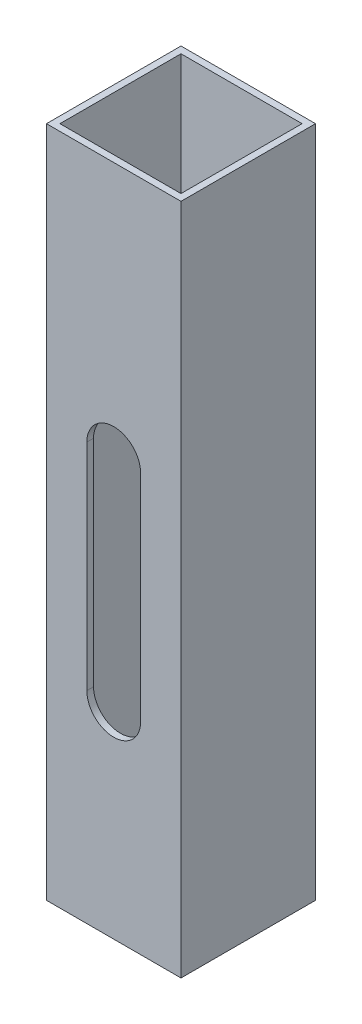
ISO-10303-21;
HEADER;
FILE_DESCRIPTION(('STEP AP214'),'2;1');
FILE_NAME('part.step','',(''),(''),'','','');
FILE_SCHEMA(('AUTOMOTIVE_DESIGN { 1 0 10303 214 1 1 1 1 }'));
ENDSEC;
DATA;
#1=APPLICATION_CONTEXT('core data for automotive mechanical design processes');
#2=APPLICATION_PROTOCOL_DEFINITION('international standard','automotive_design',2000,#1);
#3=PRODUCT_CONTEXT('',#1,'mechanical');
#4=PRODUCT('Part','Part','',(#3));
#5=PRODUCT_RELATED_PRODUCT_CATEGORY('part','',(#4));
#6=PRODUCT_DEFINITION_FORMATION('','',#4);
#7=PRODUCT_DEFINITION_CONTEXT('part definition',#1,'design');
#8=PRODUCT_DEFINITION('design','',#6,#7);
#9=PRODUCT_DEFINITION_SHAPE('','',#8);
#10=(LENGTH_UNIT() NAMED_UNIT(*) SI_UNIT(.MILLI.,.METRE.));
#11=(NAMED_UNIT(*) PLANE_ANGLE_UNIT() SI_UNIT($,.RADIAN.));
#12=(NAMED_UNIT(*) SI_UNIT($,.STERADIAN.) SOLID_ANGLE_UNIT());
#13=UNCERTAINTY_MEASURE_WITH_UNIT(LENGTH_MEASURE(1.E-05),#10,'distance_accuracy_value','');
#14=(GEOMETRIC_REPRESENTATION_CONTEXT(3) GLOBAL_UNCERTAINTY_ASSIGNED_CONTEXT((#13)) GLOBAL_UNIT_ASSIGNED_CONTEXT((#10,
#11,#12)) REPRESENTATION_CONTEXT('',''));
#15=CARTESIAN_POINT('',(0.,0.,0.));
#16=DIRECTION('',(0.,0.,1.));
#17=DIRECTION('',(1.,0.,0.));
#18=AXIS2_PLACEMENT_3D('',#15,#16,#17);
#19=CARTESIAN_POINT('',(100.,1000.,-100.));
#20=DIRECTION('',(-1.,0.,0.));
#21=DIRECTION('',(0.,0.,1.));
#22=AXIS2_PLACEMENT_3D('',#19,#20,#21);
#23=PLANE('',#22);
#24=DIRECTION('',(0.,0.,-1.));
#25=VECTOR('',#24,1.);
#26=CARTESIAN_POINT('',(100.,0.,-100.));
#27=LINE('',#26,#25);
#28=CARTESIAN_POINT('',(100.,0.,100.));
#29=VERTEX_POINT('',#28);
#30=CARTESIAN_POINT('',(100.,0.,-100.));
#31=VERTEX_POINT('',#30);
#32=EDGE_CURVE('E165',#29,#31,#27,.T.);
#33=ORIENTED_EDGE('',*,*,#32,.T.);
#34=DIRECTION('',(0.,-1.,0.));
#35=VECTOR('',#34,1.);
#36=CARTESIAN_POINT('',(100.,1000.,-100.));
#37=LINE('',#36,#35);
#38=CARTESIAN_POINT('',(100.,1000.,-100.));
#39=VERTEX_POINT('',#38);
#40=EDGE_CURVE('E11',#39,#31,#37,.T.);
#41=ORIENTED_EDGE('',*,*,#40,.F.);
#42=DIRECTION('',(0.,0.,-1.));
#43=VECTOR('',#42,1.);
#44=CARTESIAN_POINT('',(100.,1000.,-100.));
#45=LINE('',#44,#43);
#46=CARTESIAN_POINT('',(100.,1000.,100.));
#47=VERTEX_POINT('',#46);
#48=EDGE_CURVE('E193',#47,#39,#45,.T.);
#49=ORIENTED_EDGE('',*,*,#48,.F.);
#50=DIRECTION('',(0.,-1.,0.));
#51=VECTOR('',#50,1.);
#52=CARTESIAN_POINT('',(100.,1000.,100.));
#53=LINE('',#52,#51);
#54=EDGE_CURVE('E203',#47,#29,#53,.T.);
#55=ORIENTED_EDGE('',*,*,#54,.T.);
#56=EDGE_LOOP('',(#33,#41,#49,#55));
#57=FACE_BOUND('',#56,.T.);
#58=ADVANCED_FACE('F37',(#57),#23,.F.);
#59=CARTESIAN_POINT('',(-100.,1000.,-100.));
#60=DIRECTION('',(0.,0.,1.));
#61=DIRECTION('',(1.,0.,0.));
#62=AXIS2_PLACEMENT_3D('',#59,#60,#61);
#63=PLANE('',#62);
#64=DIRECTION('',(-1.,0.,0.));
#65=VECTOR('',#64,1.);
#66=CARTESIAN_POINT('',(-100.,0.,-100.));
#67=LINE('',#66,#65);
#68=CARTESIAN_POINT('',(-100.,0.,-100.));
#69=VERTEX_POINT('',#68);
#70=EDGE_CURVE('E206',#31,#69,#67,.T.);
#71=ORIENTED_EDGE('',*,*,#70,.T.);
#72=DIRECTION('',(0.,-1.,0.));
#73=VECTOR('',#72,1.);
#74=CARTESIAN_POINT('',(-100.,1000.,-100.));
#75=LINE('',#74,#73);
#76=CARTESIAN_POINT('',(-100.,1000.,-100.));
#77=VERTEX_POINT('',#76);
#78=EDGE_CURVE('E44',#77,#69,#75,.T.);
#79=ORIENTED_EDGE('',*,*,#78,.F.);
#80=DIRECTION('',(-1.,0.,0.));
#81=VECTOR('',#80,1.);
#82=CARTESIAN_POINT('',(-100.,1000.,-100.));
#83=LINE('',#82,#81);
#84=EDGE_CURVE('E196',#39,#77,#83,.T.);
#85=ORIENTED_EDGE('',*,*,#84,.F.);
#86=ORIENTED_EDGE('',*,*,#40,.T.);
#87=EDGE_LOOP('',(#71,#79,#85,#86));
#88=FACE_BOUND('',#87,.T.);
#89=ADVANCED_FACE('F236',(#88),#63,.F.);
#90=CARTESIAN_POINT('',(-100.,1000.,-100.));
#91=DIRECTION('',(1.,0.,0.));
#92=DIRECTION('',(0.,0.,-1.));
#93=AXIS2_PLACEMENT_3D('',#90,#91,#92);
#94=PLANE('',#93);
#95=DIRECTION('',(0.,0.,1.));
#96=VECTOR('',#95,1.);
#97=CARTESIAN_POINT('',(-100.,0.,-100.));
#98=LINE('',#97,#96);
#99=CARTESIAN_POINT('',(-100.,0.,100.));
#100=VERTEX_POINT('',#99);
#101=EDGE_CURVE('E208',#69,#100,#98,.T.);
#102=ORIENTED_EDGE('',*,*,#101,.T.);
#103=DIRECTION('',(0.,-1.,0.));
#104=VECTOR('',#103,1.);
#105=CARTESIAN_POINT('',(-100.,1000.,100.));
#106=LINE('',#105,#104);
#107=CARTESIAN_POINT('',(-100.,1000.,100.));
#108=VERTEX_POINT('',#107);
#109=EDGE_CURVE('E213',#108,#100,#106,.T.);
#110=ORIENTED_EDGE('',*,*,#109,.F.);
#111=DIRECTION('',(0.,0.,1.));
#112=VECTOR('',#111,1.);
#113=CARTESIAN_POINT('',(-100.,1000.,-100.));
#114=LINE('',#113,#112);
#115=EDGE_CURVE('E199',#77,#108,#114,.T.);
#116=ORIENTED_EDGE('',*,*,#115,.F.);
#117=ORIENTED_EDGE('',*,*,#78,.T.);
#118=EDGE_LOOP('',(#102,#110,#116,#117));
#119=FACE_BOUND('',#118,.T.);
#120=ADVANCED_FACE('F220',(#119),#94,.F.);
#121=CARTESIAN_POINT('',(-100.,1000.,100.));
#122=DIRECTION('',(0.,0.,-1.));
#123=DIRECTION('',(-1.,0.,0.));
#124=AXIS2_PLACEMENT_3D('',#121,#122,#123);
#125=PLANE('',#124);
#126=CARTESIAN_POINT('',(0.,620.,100.));
#127=DIRECTION('',(0.,0.,1.));
#128=DIRECTION('',(1.,0.,0.));
#129=AXIS2_PLACEMENT_3D('',#126,#127,#128);
#130=CIRCLE('',#129,40.);
#131=CARTESIAN_POINT('',(40.,620.,100.));
#132=VERTEX_POINT('',#131);
#133=CARTESIAN_POINT('',(-40.,620.,100.));
#134=VERTEX_POINT('',#133);
#135=EDGE_CURVE('E140',#132,#134,#130,.T.);
#136=ORIENTED_EDGE('',*,*,#135,.F.);
#137=DIRECTION('',(0.,1.,0.));
#138=VECTOR('',#137,1.);
#139=CARTESIAN_POINT('',(40.,300.,100.));
#140=LINE('',#139,#138);
#141=CARTESIAN_POINT('',(40.,300.,100.));
#142=VERTEX_POINT('',#141);
#143=EDGE_CURVE('E152',#142,#132,#140,.T.);
#144=ORIENTED_EDGE('',*,*,#143,.F.);
#145=CARTESIAN_POINT('',(0.,300.,100.));
#146=DIRECTION('',(0.,0.,1.));
#147=DIRECTION('',(1.,0.,0.));
#148=AXIS2_PLACEMENT_3D('',#145,#146,#147);
#149=CIRCLE('',#148,40.);
#150=CARTESIAN_POINT('',(-40.,300.,100.));
#151=VERTEX_POINT('',#150);
#152=EDGE_CURVE('E150',#151,#142,#149,.T.);
#153=ORIENTED_EDGE('',*,*,#152,.F.);
#154=DIRECTION('',(0.,-1.,0.));
#155=VECTOR('',#154,1.);
#156=CARTESIAN_POINT('',(-40.,300.,100.));
#157=LINE('',#156,#155);
#158=EDGE_CURVE('E51',#134,#151,#157,.T.);
#159=ORIENTED_EDGE('',*,*,#158,.F.);
#160=EDGE_LOOP('',(#136,#144,#153,#159));
#161=FACE_BOUND('',#160,.T.);
#162=DIRECTION('',(1.,0.,0.));
#163=VECTOR('',#162,1.);
#164=CARTESIAN_POINT('',(-100.,0.,100.));
#165=LINE('',#164,#163);
#166=EDGE_CURVE('E197',#100,#29,#165,.T.);
#167=ORIENTED_EDGE('',*,*,#166,.T.);
#168=ORIENTED_EDGE('',*,*,#54,.F.);
#169=DIRECTION('',(1.,0.,0.));
#170=VECTOR('',#169,1.);
#171=CARTESIAN_POINT('',(-100.,1000.,100.));
#172=LINE('',#171,#170);
#173=EDGE_CURVE('E201',#108,#47,#172,.T.);
#174=ORIENTED_EDGE('',*,*,#173,.F.);
#175=ORIENTED_EDGE('',*,*,#109,.T.);
#176=EDGE_LOOP('',(#167,#168,#174,#175));
#177=FACE_BOUND('',#176,.T.);
#178=ADVANCED_FACE('F229',(#161,#177),#125,.F.);
#179=CARTESIAN_POINT('',(0.,1000.,0.));
#180=DIRECTION('',(0.,1.,0.));
#181=DIRECTION('',(0.,0.,1.));
#182=AXIS2_PLACEMENT_3D('',#179,#180,#181);
#183=PLANE('',#182);
#184=DIRECTION('',(0.,0.,-1.));
#185=VECTOR('',#184,1.);
#186=CARTESIAN_POINT('',(90.,1000.,-100.));
#187=LINE('',#186,#185);
#188=CARTESIAN_POINT('',(90.,1000.,90.));
#189=VERTEX_POINT('',#188);
#190=CARTESIAN_POINT('',(90.,1000.,-90.));
#191=VERTEX_POINT('',#190);
#192=EDGE_CURVE('E180',#189,#191,#187,.T.);
#193=ORIENTED_EDGE('',*,*,#192,.F.);
#194=DIRECTION('',(1.,0.,0.));
#195=VECTOR('',#194,1.);
#196=CARTESIAN_POINT('',(-100.,1000.,90.));
#197=LINE('',#196,#195);
#198=CARTESIAN_POINT('',(-90.,1000.,90.));
#199=VERTEX_POINT('',#198);
#200=EDGE_CURVE('E170',#199,#189,#197,.T.);
#201=ORIENTED_EDGE('',*,*,#200,.F.);
#202=DIRECTION('',(0.,0.,1.));
#203=VECTOR('',#202,1.);
#204=CARTESIAN_POINT('',(-90.,1000.,-100.));
#205=LINE('',#204,#203);
#206=CARTESIAN_POINT('',(-90.,1000.,-90.));
#207=VERTEX_POINT('',#206);
#208=EDGE_CURVE('E189',#207,#199,#205,.T.);
#209=ORIENTED_EDGE('',*,*,#208,.F.);
#210=DIRECTION('',(-1.,0.,0.));
#211=VECTOR('',#210,1.);
#212=CARTESIAN_POINT('',(-100.,1000.,-90.));
#213=LINE('',#212,#211);
#214=EDGE_CURVE('E187',#191,#207,#213,.T.);
#215=ORIENTED_EDGE('',*,*,#214,.F.);
#216=EDGE_LOOP('',(#193,#201,#209,#215));
#217=FACE_BOUND('',#216,.T.);
#218=ORIENTED_EDGE('',*,*,#48,.T.);
#219=ORIENTED_EDGE('',*,*,#84,.T.);
#220=ORIENTED_EDGE('',*,*,#115,.T.);
#221=ORIENTED_EDGE('',*,*,#173,.T.);
#222=EDGE_LOOP('',(#218,#219,#220,#221));
#223=FACE_BOUND('',#222,.T.);
#224=ADVANCED_FACE('F235',(#217,#223),#183,.T.);
#225=CARTESIAN_POINT('',(0.,0.,0.));
#226=DIRECTION('',(0.,1.,0.));
#227=DIRECTION('',(0.,0.,1.));
#228=AXIS2_PLACEMENT_3D('',#225,#226,#227);
#229=PLANE('',#228);
#230=DIRECTION('',(1.,0.,0.));
#231=VECTOR('',#230,1.);
#232=CARTESIAN_POINT('',(-100.,0.,90.));
#233=LINE('',#232,#231);
#234=CARTESIAN_POINT('',(-90.,0.,90.));
#235=VERTEX_POINT('',#234);
#236=CARTESIAN_POINT('',(90.,0.,90.));
#237=VERTEX_POINT('',#236);
#238=EDGE_CURVE('E177',#235,#237,#233,.T.);
#239=ORIENTED_EDGE('',*,*,#238,.T.);
#240=DIRECTION('',(0.,0.,-1.));
#241=VECTOR('',#240,1.);
#242=CARTESIAN_POINT('',(90.,0.,-100.));
#243=LINE('',#242,#241);
#244=CARTESIAN_POINT('',(90.,0.,-90.));
#245=VERTEX_POINT('',#244);
#246=EDGE_CURVE('E161',#237,#245,#243,.T.);
#247=ORIENTED_EDGE('',*,*,#246,.T.);
#248=DIRECTION('',(-1.,0.,0.));
#249=VECTOR('',#248,1.);
#250=CARTESIAN_POINT('',(-100.,0.,-90.));
#251=LINE('',#250,#249);
#252=CARTESIAN_POINT('',(-90.,0.,-90.));
#253=VERTEX_POINT('',#252);
#254=EDGE_CURVE('E176',#245,#253,#251,.T.);
#255=ORIENTED_EDGE('',*,*,#254,.T.);
#256=DIRECTION('',(0.,0.,1.));
#257=VECTOR('',#256,1.);
#258=CARTESIAN_POINT('',(-90.,0.,-100.));
#259=LINE('',#258,#257);
#260=EDGE_CURVE('E181',#253,#235,#259,.T.);
#261=ORIENTED_EDGE('',*,*,#260,.T.);
#262=EDGE_LOOP('',(#239,#247,#255,#261));
#263=FACE_BOUND('',#262,.T.);
#264=ORIENTED_EDGE('',*,*,#32,.F.);
#265=ORIENTED_EDGE('',*,*,#166,.F.);
#266=ORIENTED_EDGE('',*,*,#101,.F.);
#267=ORIENTED_EDGE('',*,*,#70,.F.);
#268=EDGE_LOOP('',(#264,#265,#266,#267));
#269=FACE_BOUND('',#268,.T.);
#270=ADVANCED_FACE('F226',(#263,#269),#229,.F.);
#271=CARTESIAN_POINT('',(90.,1000.,-100.));
#272=DIRECTION('',(-1.,0.,0.));
#273=DIRECTION('',(0.,0.,1.));
#274=AXIS2_PLACEMENT_3D('',#271,#272,#273);
#275=PLANE('',#274);
#276=ORIENTED_EDGE('',*,*,#246,.F.);
#277=DIRECTION('',(0.,-1.,0.));
#278=VECTOR('',#277,1.);
#279=CARTESIAN_POINT('',(90.,1000.,90.));
#280=LINE('',#279,#278);
#281=EDGE_CURVE('E167',#189,#237,#280,.T.);
#282=ORIENTED_EDGE('',*,*,#281,.F.);
#283=ORIENTED_EDGE('',*,*,#192,.T.);
#284=DIRECTION('',(0.,-1.,0.));
#285=VECTOR('',#284,1.);
#286=CARTESIAN_POINT('',(90.,1000.,-90.));
#287=LINE('',#286,#285);
#288=EDGE_CURVE('E162',#191,#245,#287,.T.);
#289=ORIENTED_EDGE('',*,*,#288,.T.);
#290=EDGE_LOOP('',(#276,#282,#283,#289));
#291=FACE_BOUND('',#290,.T.);
#292=ADVANCED_FACE('F249',(#291),#275,.T.);
#293=CARTESIAN_POINT('',(-100.,1000.,-90.));
#294=DIRECTION('',(0.,0.,1.));
#295=DIRECTION('',(1.,0.,0.));
#296=AXIS2_PLACEMENT_3D('',#293,#294,#295);
#297=PLANE('',#296);
#298=ORIENTED_EDGE('',*,*,#254,.F.);
#299=ORIENTED_EDGE('',*,*,#288,.F.);
#300=ORIENTED_EDGE('',*,*,#214,.T.);
#301=DIRECTION('',(0.,-1.,0.));
#302=VECTOR('',#301,1.);
#303=CARTESIAN_POINT('',(-90.,1000.,-90.));
#304=LINE('',#303,#302);
#305=EDGE_CURVE('E166',#207,#253,#304,.T.);
#306=ORIENTED_EDGE('',*,*,#305,.T.);
#307=EDGE_LOOP('',(#298,#299,#300,#306));
#308=FACE_BOUND('',#307,.T.);
#309=ADVANCED_FACE('F260',(#308),#297,.T.);
#310=CARTESIAN_POINT('',(-90.,1000.,-100.));
#311=DIRECTION('',(1.,0.,0.));
#312=DIRECTION('',(0.,0.,-1.));
#313=AXIS2_PLACEMENT_3D('',#310,#311,#312);
#314=PLANE('',#313);
#315=ORIENTED_EDGE('',*,*,#260,.F.);
#316=ORIENTED_EDGE('',*,*,#305,.F.);
#317=ORIENTED_EDGE('',*,*,#208,.T.);
#318=DIRECTION('',(0.,-1.,0.));
#319=VECTOR('',#318,1.);
#320=CARTESIAN_POINT('',(-90.,1000.,90.));
#321=LINE('',#320,#319);
#322=EDGE_CURVE('E169',#199,#235,#321,.T.);
#323=ORIENTED_EDGE('',*,*,#322,.T.);
#324=EDGE_LOOP('',(#315,#316,#317,#323));
#325=FACE_BOUND('',#324,.T.);
#326=ADVANCED_FACE('F257',(#325),#314,.T.);
#327=CARTESIAN_POINT('',(-100.,1000.,90.));
#328=DIRECTION('',(0.,0.,-1.));
#329=DIRECTION('',(-1.,0.,0.));
#330=AXIS2_PLACEMENT_3D('',#327,#328,#329);
#331=PLANE('',#330);
#332=DIRECTION('',(0.,1.,0.));
#333=VECTOR('',#332,1.);
#334=CARTESIAN_POINT('',(40.,300.,90.));
#335=LINE('',#334,#333);
#336=CARTESIAN_POINT('',(40.,300.,90.));
#337=VERTEX_POINT('',#336);
#338=CARTESIAN_POINT('',(40.,620.,90.));
#339=VERTEX_POINT('',#338);
#340=EDGE_CURVE('E146',#337,#339,#335,.T.);
#341=ORIENTED_EDGE('',*,*,#340,.T.);
#342=CARTESIAN_POINT('',(0.,620.,90.));
#343=DIRECTION('',(0.,0.,-1.));
#344=DIRECTION('',(-1.,0.,0.));
#345=AXIS2_PLACEMENT_3D('',#342,#343,#344);
#346=CIRCLE('',#345,40.);
#347=CARTESIAN_POINT('',(-40.,620.,90.));
#348=VERTEX_POINT('',#347);
#349=EDGE_CURVE('E134',#339,#348,#346,.F.);
#350=ORIENTED_EDGE('',*,*,#349,.T.);
#351=DIRECTION('',(0.,-1.,0.));
#352=VECTOR('',#351,1.);
#353=CARTESIAN_POINT('',(-40.,300.,90.));
#354=LINE('',#353,#352);
#355=CARTESIAN_POINT('',(-40.,300.,90.));
#356=VERTEX_POINT('',#355);
#357=EDGE_CURVE('E124',#348,#356,#354,.T.);
#358=ORIENTED_EDGE('',*,*,#357,.T.);
#359=CARTESIAN_POINT('',(0.,300.,90.));
#360=DIRECTION('',(0.,0.,-1.));
#361=DIRECTION('',(-1.,0.,0.));
#362=AXIS2_PLACEMENT_3D('',#359,#360,#361);
#363=CIRCLE('',#362,40.);
#364=EDGE_CURVE('E133',#356,#337,#363,.F.);
#365=ORIENTED_EDGE('',*,*,#364,.T.);
#366=EDGE_LOOP('',(#341,#350,#358,#365));
#367=FACE_BOUND('',#366,.T.);
#368=ORIENTED_EDGE('',*,*,#238,.F.);
#369=ORIENTED_EDGE('',*,*,#322,.F.);
#370=ORIENTED_EDGE('',*,*,#200,.T.);
#371=ORIENTED_EDGE('',*,*,#281,.T.);
#372=EDGE_LOOP('',(#368,#369,#370,#371));
#373=FACE_BOUND('',#372,.T.);
#374=ADVANCED_FACE('F144',(#367,#373),#331,.T.);
#375=CARTESIAN_POINT('',(40.,300.,-100.001));
#376=DIRECTION('',(1.,0.,0.));
#377=DIRECTION('',(0.,0.,-1.));
#378=AXIS2_PLACEMENT_3D('',#375,#376,#377);
#379=PLANE('',#378);
#380=DIRECTION('',(0.,0.,1.));
#381=VECTOR('',#380,1.);
#382=CARTESIAN_POINT('',(40.,300.,-100.001));
#383=LINE('',#382,#381);
#384=EDGE_CURVE('E59',#337,#142,#383,.T.);
#385=ORIENTED_EDGE('',*,*,#384,.T.);
#386=ORIENTED_EDGE('',*,*,#143,.T.);
#387=DIRECTION('',(0.,0.,1.));
#388=VECTOR('',#387,1.);
#389=CARTESIAN_POINT('',(40.,620.,-100.001));
#390=LINE('',#389,#388);
#391=EDGE_CURVE('E141',#339,#132,#390,.T.);
#392=ORIENTED_EDGE('',*,*,#391,.F.);
#393=ORIENTED_EDGE('',*,*,#340,.F.);
#394=EDGE_LOOP('',(#385,#386,#392,#393));
#395=FACE_BOUND('',#394,.T.);
#396=ADVANCED_FACE('F256',(#395),#379,.F.);
#397=CARTESIAN_POINT('',(0.,620.,-100.001));
#398=DIRECTION('',(0.,0.,1.));
#399=DIRECTION('',(1.,0.,0.));
#400=AXIS2_PLACEMENT_3D('',#397,#398,#399);
#401=CYLINDRICAL_SURFACE('',#400,40.);
#402=ORIENTED_EDGE('',*,*,#391,.T.);
#403=ORIENTED_EDGE('',*,*,#135,.T.);
#404=DIRECTION('',(0.,0.,1.));
#405=VECTOR('',#404,1.);
#406=CARTESIAN_POINT('',(-40.,620.,-100.001));
#407=LINE('',#406,#405);
#408=EDGE_CURVE('E127',#348,#134,#407,.T.);
#409=ORIENTED_EDGE('',*,*,#408,.F.);
#410=ORIENTED_EDGE('',*,*,#349,.F.);
#411=EDGE_LOOP('',(#402,#403,#409,#410));
#412=FACE_BOUND('',#411,.T.);
#413=ADVANCED_FACE('F137',(#412),#401,.F.);
#414=CARTESIAN_POINT('',(-40.,300.,-100.001));
#415=DIRECTION('',(-1.,0.,0.));
#416=DIRECTION('',(0.,0.,1.));
#417=AXIS2_PLACEMENT_3D('',#414,#415,#416);
#418=PLANE('',#417);
#419=ORIENTED_EDGE('',*,*,#408,.T.);
#420=ORIENTED_EDGE('',*,*,#158,.T.);
#421=DIRECTION('',(0.,0.,1.));
#422=VECTOR('',#421,1.);
#423=CARTESIAN_POINT('',(-40.,300.,-100.001));
#424=LINE('',#423,#422);
#425=EDGE_CURVE('E129',#356,#151,#424,.T.);
#426=ORIENTED_EDGE('',*,*,#425,.F.);
#427=ORIENTED_EDGE('',*,*,#357,.F.);
#428=EDGE_LOOP('',(#419,#420,#426,#427));
#429=FACE_BOUND('',#428,.T.);
#430=ADVANCED_FACE('F126',(#429),#418,.F.);
#431=CARTESIAN_POINT('',(0.,300.,-100.001));
#432=DIRECTION('',(0.,0.,1.));
#433=DIRECTION('',(1.,0.,0.));
#434=AXIS2_PLACEMENT_3D('',#431,#432,#433);
#435=CYLINDRICAL_SURFACE('',#434,40.);
#436=ORIENTED_EDGE('',*,*,#425,.T.);
#437=ORIENTED_EDGE('',*,*,#152,.T.);
#438=ORIENTED_EDGE('',*,*,#384,.F.);
#439=ORIENTED_EDGE('',*,*,#364,.F.);
#440=EDGE_LOOP('',(#436,#437,#438,#439));
#441=FACE_BOUND('',#440,.T.);
#442=ADVANCED_FACE('F268',(#441),#435,.F.);
#443=CLOSED_SHELL('',(#58,#89,#120,#178,#224,#270,#292,#309,#326,#374,#396,#413,#430,#442));
#444=MANIFOLD_SOLID_BREP('B2',#443);
#445=ADVANCED_BREP_SHAPE_REPRESENTATION('',(#18,#444),#14);
#446=SHAPE_DEFINITION_REPRESENTATION(#9,#445);
ENDSEC;
END-ISO-10303-21;
